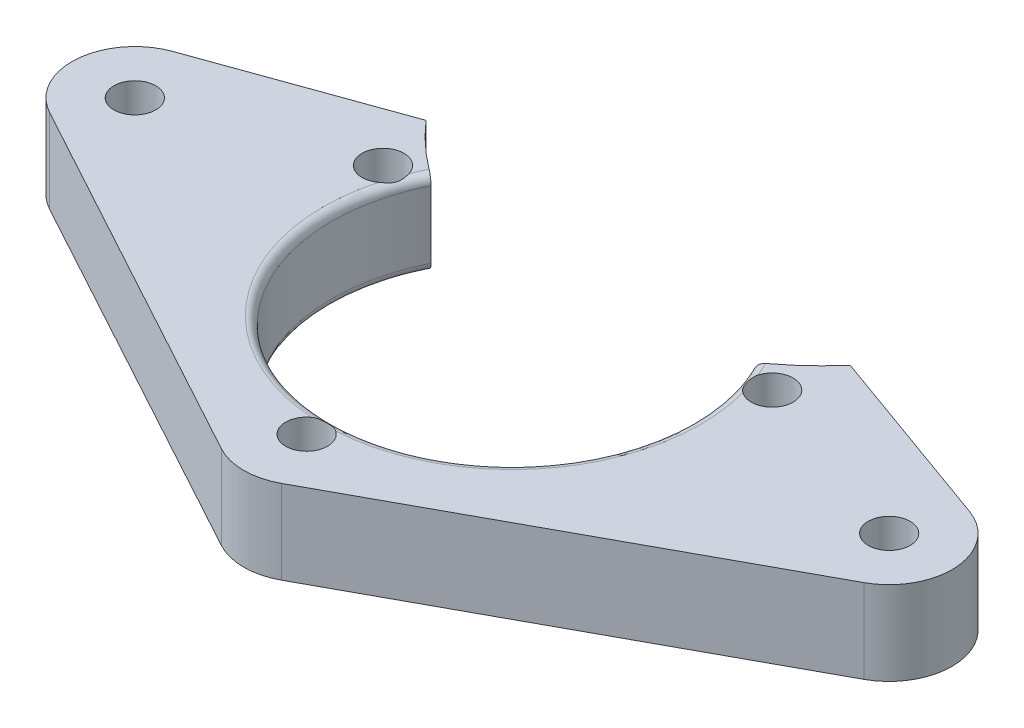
ISO-10303-21;
HEADER;
FILE_DESCRIPTION(('STEP AP214'),'2;1');
FILE_NAME('part.step','',(''),(''),'','','');
FILE_SCHEMA(('AUTOMOTIVE_DESIGN { 1 0 10303 214 1 1 1 1 }'));
ENDSEC;
DATA;
#1=APPLICATION_CONTEXT('core data for automotive mechanical design processes');
#2=APPLICATION_PROTOCOL_DEFINITION('international standard','automotive_design',2000,#1);
#3=PRODUCT_CONTEXT('',#1,'mechanical');
#4=PRODUCT('Part','Part','',(#3));
#5=PRODUCT_RELATED_PRODUCT_CATEGORY('part','',(#4));
#6=PRODUCT_DEFINITION_FORMATION('','',#4);
#7=PRODUCT_DEFINITION_CONTEXT('part definition',#1,'design');
#8=PRODUCT_DEFINITION('design','',#6,#7);
#9=PRODUCT_DEFINITION_SHAPE('','',#8);
#10=(LENGTH_UNIT() NAMED_UNIT(*) SI_UNIT(.MILLI.,.METRE.));
#11=(NAMED_UNIT(*) PLANE_ANGLE_UNIT() SI_UNIT($,.RADIAN.));
#12=(NAMED_UNIT(*) SI_UNIT($,.STERADIAN.) SOLID_ANGLE_UNIT());
#13=UNCERTAINTY_MEASURE_WITH_UNIT(LENGTH_MEASURE(1.E-05),#10,'distance_accuracy_value','');
#14=(GEOMETRIC_REPRESENTATION_CONTEXT(3) GLOBAL_UNCERTAINTY_ASSIGNED_CONTEXT((#13)) GLOBAL_UNIT_ASSIGNED_CONTEXT((#10,
#11,#12)) REPRESENTATION_CONTEXT('',''));
#15=CARTESIAN_POINT('',(0.,0.,0.));
#16=DIRECTION('',(0.,0.,1.));
#17=DIRECTION('',(1.,0.,0.));
#18=AXIS2_PLACEMENT_3D('',#15,#16,#17);
#19=CARTESIAN_POINT('',(0.,10.,0.));
#20=DIRECTION('',(0.,1.,0.));
#21=DIRECTION('',(0.,0.,1.));
#22=AXIS2_PLACEMENT_3D('',#19,#20,#21);
#23=PLANE('',#22);
#24=CARTESIAN_POINT('',(0.,10.,-37.));
#25=DIRECTION('',(0.,1.,0.));
#26=DIRECTION('',(0.,0.,1.));
#27=AXIS2_PLACEMENT_3D('',#24,#25,#26);
#28=CIRCLE('',#27,33.5);
#29=CARTESIAN_POINT('',(20.0675266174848,10.,-10.1756756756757));
#30=VERTEX_POINT('',#29);
#31=CARTESIAN_POINT('',(25.3037535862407,10.,-15.0461836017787));
#32=VERTEX_POINT('',#31);
#33=EDGE_CURVE('E208',#30,#32,#28,.T.);
#34=ORIENTED_EDGE('',*,*,#33,.F.);
#35=CARTESIAN_POINT('',(0.,10.,0.));
#36=DIRECTION('',(0.,1.,0.));
#37=DIRECTION('',(0.,0.,1.));
#38=AXIS2_PLACEMENT_3D('',#35,#36,#37);
#39=CIRCLE('',#38,22.5);
#40=CARTESIAN_POINT('',(20.8184791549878,10.,-8.53468954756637));
#41=VERTEX_POINT('',#40);
#42=EDGE_CURVE('E507',#30,#41,#39,.F.);
#43=ORIENTED_EDGE('',*,*,#42,.T.);
#44=CARTESIAN_POINT('',(23.2161733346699,10.,-7.82683177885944));
#45=DIRECTION('',(0.,1.,0.));
#46=DIRECTION('',(0.,0.,1.));
#47=AXIS2_PLACEMENT_3D('',#44,#45,#46);
#48=CIRCLE('',#47,2.5);
#49=CARTESIAN_POINT('',(21.7364474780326,10.,-5.81178552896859));
#50=VERTEX_POINT('',#49);
#51=EDGE_CURVE('E269',#50,#41,#48,.T.);
#52=ORIENTED_EDGE('',*,*,#51,.F.);
#53=CARTESIAN_POINT('',(0.,10.,0.));
#54=DIRECTION('',(0.,1.,0.));
#55=DIRECTION('',(0.,0.,1.));
#56=AXIS2_PLACEMENT_3D('',#53,#54,#55);
#57=CIRCLE('',#56,22.5);
#58=CARTESIAN_POINT('',(1.43673867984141,10.,22.4540816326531));
#59=VERTEX_POINT('',#58);
#60=EDGE_CURVE('E509',#50,#59,#57,.F.);
#61=ORIENTED_EDGE('',*,*,#60,.T.);
#62=CARTESIAN_POINT('',(0.,10.,24.5));
#63=DIRECTION('',(0.,1.,0.));
#64=DIRECTION('',(0.,0.,1.));
#65=AXIS2_PLACEMENT_3D('',#62,#63,#64);
#66=CIRCLE('',#65,2.5);
#67=CARTESIAN_POINT('',(-1.43673867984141,10.,22.4540816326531));
#68=VERTEX_POINT('',#67);
#69=EDGE_CURVE('E251',#68,#59,#66,.T.);
#70=ORIENTED_EDGE('',*,*,#69,.F.);
#71=CARTESIAN_POINT('',(0.,10.,0.));
#72=DIRECTION('',(0.,1.,0.));
#73=DIRECTION('',(0.,0.,1.));
#74=AXIS2_PLACEMENT_3D('',#71,#72,#73);
#75=CIRCLE('',#74,22.5);
#76=CARTESIAN_POINT('',(-21.7364474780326,10.,-5.81178552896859));
#77=VERTEX_POINT('',#76);
#78=EDGE_CURVE('E59',#68,#77,#75,.F.);
#79=ORIENTED_EDGE('',*,*,#78,.T.);
#80=CARTESIAN_POINT('',(-23.2161733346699,10.,-7.82683177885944));
#81=DIRECTION('',(0.,1.,0.));
#82=DIRECTION('',(0.,0.,1.));
#83=AXIS2_PLACEMENT_3D('',#80,#81,#82);
#84=CIRCLE('',#83,2.5);
#85=CARTESIAN_POINT('',(-20.8184791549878,10.,-8.53468954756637));
#86=VERTEX_POINT('',#85);
#87=EDGE_CURVE('E264',#86,#77,#84,.T.);
#88=ORIENTED_EDGE('',*,*,#87,.F.);
#89=CARTESIAN_POINT('',(0.,10.,0.));
#90=DIRECTION('',(0.,1.,0.));
#91=DIRECTION('',(0.,0.,1.));
#92=AXIS2_PLACEMENT_3D('',#89,#90,#91);
#93=CIRCLE('',#92,22.5);
#94=CARTESIAN_POINT('',(-20.0675266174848,10.,-10.1756756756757));
#95=VERTEX_POINT('',#94);
#96=EDGE_CURVE('E516',#86,#95,#93,.F.);
#97=ORIENTED_EDGE('',*,*,#96,.T.);
#98=CARTESIAN_POINT('',(0.,10.,-37.));
#99=DIRECTION('',(0.,1.,0.));
#100=DIRECTION('',(0.,0.,1.));
#101=AXIS2_PLACEMENT_3D('',#98,#99,#100);
#102=CIRCLE('',#101,33.5);
#103=CARTESIAN_POINT('',(-25.3037535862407,10.,-15.0461836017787));
#104=VERTEX_POINT('',#103);
#105=EDGE_CURVE('E192',#104,#95,#102,.T.);
#106=ORIENTED_EDGE('',*,*,#105,.F.);
#107=DIRECTION('',(0.941098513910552,0.,-0.338132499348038));
#108=VECTOR('',#107,1.);
#109=CARTESIAN_POINT('',(-7.68100516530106,10.,-21.3779585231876));
#110=LINE('',#109,#108);
#111=CARTESIAN_POINT('',(-47.5359937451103,10.,-7.05823885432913));
#112=VERTEX_POINT('',#111);
#113=EDGE_CURVE('E225',#112,#104,#110,.T.);
#114=ORIENTED_EDGE('',*,*,#113,.F.);
#115=CARTESIAN_POINT('',(-45.,10.,0.));
#116=DIRECTION('',(0.,1.,0.));
#117=DIRECTION('',(0.,0.,1.));
#118=AXIS2_PLACEMENT_3D('',#115,#116,#117);
#119=CIRCLE('',#118,7.5);
#120=CARTESIAN_POINT('',(-48.5862619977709,10.,6.58701183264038));
#121=VERTEX_POINT('',#120);
#122=EDGE_CURVE('E222',#112,#121,#119,.T.);
#123=ORIENTED_EDGE('',*,*,#122,.T.);
#124=DIRECTION('',(0.878268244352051,0.,0.47816826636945));
#125=VECTOR('',#124,1.);
#126=CARTESIAN_POINT('',(-13.8752820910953,10.,25.4852120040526));
#127=LINE('',#126,#125);
#128=CARTESIAN_POINT('',(-3.58626199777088,10.,31.0870118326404));
#129=VERTEX_POINT('',#128);
#130=EDGE_CURVE('E219',#121,#129,#127,.T.);
#131=ORIENTED_EDGE('',*,*,#130,.T.);
#132=CARTESIAN_POINT('',(0.,10.,24.5));
#133=DIRECTION('',(0.,1.,0.));
#134=DIRECTION('',(0.,0.,1.));
#135=AXIS2_PLACEMENT_3D('',#132,#133,#134);
#136=CIRCLE('',#135,7.5);
#137=CARTESIAN_POINT('',(3.58626199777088,10.,31.0870118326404));
#138=VERTEX_POINT('',#137);
#139=EDGE_CURVE('E216',#129,#138,#136,.T.);
#140=ORIENTED_EDGE('',*,*,#139,.T.);
#141=DIRECTION('',(-0.878268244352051,0.,0.47816826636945));
#142=VECTOR('',#141,1.);
#143=CARTESIAN_POINT('',(13.8752820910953,10.,25.4852120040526));
#144=LINE('',#143,#142);
#145=CARTESIAN_POINT('',(48.5862619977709,10.,6.58701183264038));
#146=VERTEX_POINT('',#145);
#147=EDGE_CURVE('E213',#146,#138,#144,.T.);
#148=ORIENTED_EDGE('',*,*,#147,.F.);
#149=CARTESIAN_POINT('',(45.,10.,0.));
#150=DIRECTION('',(0.,1.,0.));
#151=DIRECTION('',(0.,0.,1.));
#152=AXIS2_PLACEMENT_3D('',#149,#150,#151);
#153=CIRCLE('',#152,7.5);
#154=CARTESIAN_POINT('',(47.5359937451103,10.,-7.05823885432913));
#155=VERTEX_POINT('',#154);
#156=EDGE_CURVE('E211',#146,#155,#153,.T.);
#157=ORIENTED_EDGE('',*,*,#156,.T.);
#158=DIRECTION('',(-0.94109851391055,0.,-0.338132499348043));
#159=VECTOR('',#158,1.);
#160=CARTESIAN_POINT('',(7.68100516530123,10.,-21.3779585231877));
#161=LINE('',#160,#159);
#162=EDGE_CURVE('E181',#155,#32,#161,.T.);
#163=ORIENTED_EDGE('',*,*,#162,.T.);
#164=EDGE_LOOP('',(#34,#43,#52,#61,#70,#79,#88,#97,#106,#114,#123,#131,#140,#148,#157,#163));
#165=FACE_BOUND('',#164,.T.);
#166=CARTESIAN_POINT('',(45.,10.,0.));
#167=DIRECTION('',(0.,1.,0.));
#168=DIRECTION('',(0.,0.,1.));
#169=AXIS2_PLACEMENT_3D('',#166,#167,#168);
#170=CIRCLE('',#169,2.49999999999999);
#171=CARTESIAN_POINT('',(45.,10.,2.49999999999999));
#172=VERTEX_POINT('',#171);
#173=EDGE_CURVE('E233',#172,#172,#170,.T.);
#174=ORIENTED_EDGE('',*,*,#173,.F.);
#175=EDGE_LOOP('',(#174));
#176=FACE_BOUND('',#175,.T.);
#177=CARTESIAN_POINT('',(-45.,10.,0.));
#178=DIRECTION('',(0.,1.,0.));
#179=DIRECTION('',(0.,0.,1.));
#180=AXIS2_PLACEMENT_3D('',#177,#178,#179);
#181=CIRCLE('',#180,2.49999999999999);
#182=CARTESIAN_POINT('',(-45.,10.,2.49999999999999));
#183=VERTEX_POINT('',#182);
#184=EDGE_CURVE('E252',#183,#183,#181,.T.);
#185=ORIENTED_EDGE('',*,*,#184,.F.);
#186=EDGE_LOOP('',(#185));
#187=FACE_BOUND('',#186,.T.);
#188=ADVANCED_FACE('F33',(#165,#176,#187),#23,.T.);
#189=CARTESIAN_POINT('',(0.,0.,0.));
#190=DIRECTION('',(0.,1.,0.));
#191=DIRECTION('',(0.,0.,1.));
#192=AXIS2_PLACEMENT_3D('',#189,#190,#191);
#193=PLANE('',#192);
#194=CARTESIAN_POINT('',(0.,0.,-37.));
#195=DIRECTION('',(0.,1.,0.));
#196=DIRECTION('',(0.,0.,1.));
#197=AXIS2_PLACEMENT_3D('',#194,#195,#196);
#198=CIRCLE('',#197,33.5);
#199=CARTESIAN_POINT('',(-25.3037535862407,0.,-15.0461836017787));
#200=VERTEX_POINT('',#199);
#201=CARTESIAN_POINT('',(-20.0675266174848,0.,-10.1756756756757));
#202=VERTEX_POINT('',#201);
#203=EDGE_CURVE('E205',#200,#202,#198,.T.);
#204=ORIENTED_EDGE('',*,*,#203,.T.);
#205=CARTESIAN_POINT('',(0.,0.,0.));
#206=DIRECTION('',(0.,1.,0.));
#207=DIRECTION('',(0.,0.,1.));
#208=AXIS2_PLACEMENT_3D('',#205,#206,#207);
#209=CIRCLE('',#208,22.5);
#210=CARTESIAN_POINT('',(-20.8184791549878,0.,-8.53468954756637));
#211=VERTEX_POINT('',#210);
#212=EDGE_CURVE('E282',#202,#211,#209,.T.);
#213=ORIENTED_EDGE('',*,*,#212,.T.);
#214=CARTESIAN_POINT('',(-23.2161733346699,0.,-7.82683177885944));
#215=DIRECTION('',(0.,1.,0.));
#216=DIRECTION('',(0.,0.,1.));
#217=AXIS2_PLACEMENT_3D('',#214,#215,#216);
#218=CIRCLE('',#217,2.5);
#219=CARTESIAN_POINT('',(-21.7364474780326,0.,-5.81178552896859));
#220=VERTEX_POINT('',#219);
#221=EDGE_CURVE('E260',#211,#220,#218,.T.);
#222=ORIENTED_EDGE('',*,*,#221,.T.);
#223=CARTESIAN_POINT('',(0.,0.,0.));
#224=DIRECTION('',(0.,1.,0.));
#225=DIRECTION('',(0.,0.,1.));
#226=AXIS2_PLACEMENT_3D('',#223,#224,#225);
#227=CIRCLE('',#226,22.5);
#228=CARTESIAN_POINT('',(-1.43673867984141,0.,22.4540816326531));
#229=VERTEX_POINT('',#228);
#230=EDGE_CURVE('E280',#220,#229,#227,.T.);
#231=ORIENTED_EDGE('',*,*,#230,.T.);
#232=CARTESIAN_POINT('',(0.,0.,24.5));
#233=DIRECTION('',(0.,1.,0.));
#234=DIRECTION('',(0.,0.,1.));
#235=AXIS2_PLACEMENT_3D('',#232,#233,#234);
#236=CIRCLE('',#235,2.5);
#237=CARTESIAN_POINT('',(1.43673867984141,0.,22.4540816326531));
#238=VERTEX_POINT('',#237);
#239=EDGE_CURVE('E272',#229,#238,#236,.T.);
#240=ORIENTED_EDGE('',*,*,#239,.T.);
#241=CARTESIAN_POINT('',(0.,0.,0.));
#242=DIRECTION('',(0.,1.,0.));
#243=DIRECTION('',(0.,0.,1.));
#244=AXIS2_PLACEMENT_3D('',#241,#242,#243);
#245=CIRCLE('',#244,22.5);
#246=CARTESIAN_POINT('',(21.7364474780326,0.,-5.81178552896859));
#247=VERTEX_POINT('',#246);
#248=EDGE_CURVE('E278',#238,#247,#245,.T.);
#249=ORIENTED_EDGE('',*,*,#248,.T.);
#250=CARTESIAN_POINT('',(23.2161733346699,0.,-7.82683177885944));
#251=DIRECTION('',(0.,1.,0.));
#252=DIRECTION('',(0.,0.,1.));
#253=AXIS2_PLACEMENT_3D('',#250,#251,#252);
#254=CIRCLE('',#253,2.5);
#255=CARTESIAN_POINT('',(20.8184791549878,0.,-8.53468954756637));
#256=VERTEX_POINT('',#255);
#257=EDGE_CURVE('E266',#247,#256,#254,.T.);
#258=ORIENTED_EDGE('',*,*,#257,.T.);
#259=CARTESIAN_POINT('',(0.,0.,0.));
#260=DIRECTION('',(0.,1.,0.));
#261=DIRECTION('',(0.,0.,1.));
#262=AXIS2_PLACEMENT_3D('',#259,#260,#261);
#263=CIRCLE('',#262,22.5);
#264=CARTESIAN_POINT('',(20.0675266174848,0.,-10.1756756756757));
#265=VERTEX_POINT('',#264);
#266=EDGE_CURVE('E263',#256,#265,#263,.T.);
#267=ORIENTED_EDGE('',*,*,#266,.T.);
#268=CARTESIAN_POINT('',(0.,0.,-37.));
#269=DIRECTION('',(0.,1.,0.));
#270=DIRECTION('',(0.,0.,1.));
#271=AXIS2_PLACEMENT_3D('',#268,#269,#270);
#272=CIRCLE('',#271,33.5);
#273=CARTESIAN_POINT('',(25.3037535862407,0.,-15.0461836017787));
#274=VERTEX_POINT('',#273);
#275=EDGE_CURVE('E189',#265,#274,#272,.T.);
#276=ORIENTED_EDGE('',*,*,#275,.T.);
#277=DIRECTION('',(-0.94109851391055,0.,-0.338132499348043));
#278=VECTOR('',#277,1.);
#279=CARTESIAN_POINT('',(7.68100516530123,0.,-21.3779585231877));
#280=LINE('',#279,#278);
#281=CARTESIAN_POINT('',(47.5359937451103,0.,-7.05823885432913));
#282=VERTEX_POINT('',#281);
#283=EDGE_CURVE('E174',#282,#274,#280,.T.);
#284=ORIENTED_EDGE('',*,*,#283,.F.);
#285=CARTESIAN_POINT('',(45.,0.,0.));
#286=DIRECTION('',(0.,1.,0.));
#287=DIRECTION('',(0.,0.,1.));
#288=AXIS2_PLACEMENT_3D('',#285,#286,#287);
#289=CIRCLE('',#288,7.5);
#290=CARTESIAN_POINT('',(48.5862619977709,0.,6.58701183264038));
#291=VERTEX_POINT('',#290);
#292=EDGE_CURVE('E162',#291,#282,#289,.T.);
#293=ORIENTED_EDGE('',*,*,#292,.F.);
#294=DIRECTION('',(-0.878268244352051,0.,0.47816826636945));
#295=VECTOR('',#294,1.);
#296=CARTESIAN_POINT('',(13.8752820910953,0.,25.4852120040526));
#297=LINE('',#296,#295);
#298=CARTESIAN_POINT('',(3.58626199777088,0.,31.0870118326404));
#299=VERTEX_POINT('',#298);
#300=EDGE_CURVE('E173',#291,#299,#297,.T.);
#301=ORIENTED_EDGE('',*,*,#300,.T.);
#302=CARTESIAN_POINT('',(0.,0.,24.5));
#303=DIRECTION('',(0.,1.,0.));
#304=DIRECTION('',(0.,0.,1.));
#305=AXIS2_PLACEMENT_3D('',#302,#303,#304);
#306=CIRCLE('',#305,7.5);
#307=CARTESIAN_POINT('',(-3.58626199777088,0.,31.0870118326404));
#308=VERTEX_POINT('',#307);
#309=EDGE_CURVE('E196',#308,#299,#306,.T.);
#310=ORIENTED_EDGE('',*,*,#309,.F.);
#311=DIRECTION('',(0.878268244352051,0.,0.47816826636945));
#312=VECTOR('',#311,1.);
#313=CARTESIAN_POINT('',(-13.8752820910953,0.,25.4852120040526));
#314=LINE('',#313,#312);
#315=CARTESIAN_POINT('',(-48.5862619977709,0.,6.58701183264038));
#316=VERTEX_POINT('',#315);
#317=EDGE_CURVE('E198',#316,#308,#314,.T.);
#318=ORIENTED_EDGE('',*,*,#317,.F.);
#319=CARTESIAN_POINT('',(-45.,0.,0.));
#320=DIRECTION('',(0.,1.,0.));
#321=DIRECTION('',(0.,0.,1.));
#322=AXIS2_PLACEMENT_3D('',#319,#320,#321);
#323=CIRCLE('',#322,7.5);
#324=CARTESIAN_POINT('',(-47.5359937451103,0.,-7.05823885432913));
#325=VERTEX_POINT('',#324);
#326=EDGE_CURVE('E200',#325,#316,#323,.T.);
#327=ORIENTED_EDGE('',*,*,#326,.F.);
#328=DIRECTION('',(0.941098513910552,0.,-0.338132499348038));
#329=VECTOR('',#328,1.);
#330=CARTESIAN_POINT('',(-7.68100516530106,0.,-21.3779585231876));
#331=LINE('',#330,#329);
#332=EDGE_CURVE('E202',#325,#200,#331,.T.);
#333=ORIENTED_EDGE('',*,*,#332,.T.);
#334=EDGE_LOOP('',(#204,#213,#222,#231,#240,#249,#258,#267,#276,#284,#293,#301,#310,#318,#327,#333));
#335=FACE_BOUND('',#334,.T.);
#336=CARTESIAN_POINT('',(45.,0.,0.));
#337=DIRECTION('',(0.,1.,0.));
#338=DIRECTION('',(0.,0.,1.));
#339=AXIS2_PLACEMENT_3D('',#336,#337,#338);
#340=CIRCLE('',#339,2.49999999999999);
#341=CARTESIAN_POINT('',(45.,0.,2.49999999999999));
#342=VERTEX_POINT('',#341);
#343=EDGE_CURVE('E255',#342,#342,#340,.T.);
#344=ORIENTED_EDGE('',*,*,#343,.T.);
#345=EDGE_LOOP('',(#344));
#346=FACE_BOUND('',#345,.T.);
#347=CARTESIAN_POINT('',(-45.,0.,0.));
#348=DIRECTION('',(0.,1.,0.));
#349=DIRECTION('',(0.,0.,1.));
#350=AXIS2_PLACEMENT_3D('',#347,#348,#349);
#351=CIRCLE('',#350,2.49999999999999);
#352=CARTESIAN_POINT('',(-45.,0.,2.49999999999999));
#353=VERTEX_POINT('',#352);
#354=EDGE_CURVE('E248',#353,#353,#351,.T.);
#355=ORIENTED_EDGE('',*,*,#354,.T.);
#356=EDGE_LOOP('',(#355));
#357=FACE_BOUND('',#356,.T.);
#358=ADVANCED_FACE('F186',(#335,#346,#357),#193,.F.);
#359=CARTESIAN_POINT('',(0.,0.,24.5));
#360=DIRECTION('',(0.,1.,0.));
#361=DIRECTION('',(0.,0.,1.));
#362=AXIS2_PLACEMENT_3D('',#359,#360,#361);
#363=CYLINDRICAL_SURFACE('',#362,2.5);
#364=ORIENTED_EDGE('',*,*,#239,.F.);
#365=CARTESIAN_POINT('',(-1.43673867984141,0.,22.4540816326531));
#366=CARTESIAN_POINT('',(-1.38761921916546,1.71798852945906E-05,22.419579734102));
#367=CARTESIAN_POINT('',(-1.33730693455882,0.00211480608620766,22.3868970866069));
#368=CARTESIAN_POINT('',(-1.23470646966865,0.0093487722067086,22.3253590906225));
#369=CARTESIAN_POINT('',(-1.1824217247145,0.0144800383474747,22.2964974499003));
#370=CARTESIAN_POINT('',(-1.07586457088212,0.0266959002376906,22.2425449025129));
#371=CARTESIAN_POINT('',(-1.02158381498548,0.0337897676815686,22.2174727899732));
#372=CARTESIAN_POINT('',(-0.911453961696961,0.0489031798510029,22.1713055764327));
#373=CARTESIAN_POINT('',(-0.855604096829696,0.0569231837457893,22.1502124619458));
#374=CARTESIAN_POINT('',(-0.739379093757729,0.0733634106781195,22.1110071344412));
#375=CARTESIAN_POINT('',(-0.678925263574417,0.0817810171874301,22.0931266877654));
#376=CARTESIAN_POINT('',(-0.556704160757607,0.0974976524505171,22.0619563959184));
#377=CARTESIAN_POINT('',(-0.49493703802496,0.104796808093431,22.0486660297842));
#378=CARTESIAN_POINT('',(-0.370636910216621,0.117303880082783,22.0268256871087));
#379=CARTESIAN_POINT('',(-0.308108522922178,0.122520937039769,22.0182549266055));
#380=CARTESIAN_POINT('',(-0.182411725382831,0.130200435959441,22.0058642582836));
#381=CARTESIAN_POINT('',(-0.119243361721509,0.132663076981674,22.002044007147));
#382=CARTESIAN_POINT('',(0.00969564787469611,0.134515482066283,21.999155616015));
#383=CARTESIAN_POINT('',(0.0754725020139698,0.133782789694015,22.0002768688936));
#384=CARTESIAN_POINT('',(0.206615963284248,0.129076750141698,22.0076868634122));
#385=CARTESIAN_POINT('',(0.271982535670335,0.125103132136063,22.0139760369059));
#386=CARTESIAN_POINT('',(0.402129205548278,0.11448865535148,22.0316750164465));
#387=CARTESIAN_POINT('',(0.466904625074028,0.107834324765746,22.0431107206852));
#388=CARTESIAN_POINT('',(0.595168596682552,0.092812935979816,22.0709911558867));
#389=CARTESIAN_POINT('',(0.6586568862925,0.0844455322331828,22.0874368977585));
#390=CARTESIAN_POINT('',(0.785066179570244,0.0670090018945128,22.1255322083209));
#391=CARTESIAN_POINT('',(0.847962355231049,0.0579308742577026,22.1472599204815));
#392=CARTESIAN_POINT('',(0.971880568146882,0.040507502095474,22.1956839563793));
#393=CARTESIAN_POINT('',(1.03290356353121,0.0321618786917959,22.2223776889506));
#394=CARTESIAN_POINT('',(1.15249247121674,0.0176283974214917,22.2805071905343));
#395=CARTESIAN_POINT('',(1.21107081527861,0.0114280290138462,22.3119138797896));
#396=CARTESIAN_POINT('',(1.32583798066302,0.00262344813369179,22.3794791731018));
#397=CARTESIAN_POINT('',(1.38202200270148,2.61568474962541E-05,22.4156467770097));
#398=CARTESIAN_POINT('',(1.43673867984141,0.,22.4540816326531));
#399=B_SPLINE_CURVE_WITH_KNOTS('',3,(#365,#366,#367,#368,#369,#370,#371,#372,#373,#374,#375,
#376,#377,#378,#379,#380,#381,#382,#383,#384,#385,#386,#387,#388,#389,#390,#391,#392,#393,#394,
#395,#396,#397,#398),.UNSPECIFIED.,.F.,.F.,(4,2,2,2,2,2,2,2,2,2,2,2,2,2,2,2,4),(0.,
0.179905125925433,0.359510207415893,0.539978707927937,0.720537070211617,0.911162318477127,
1.10176592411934,1.29152330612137,1.48126697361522,1.67834487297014,1.87543924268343,
2.07353671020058,2.27167417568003,2.47294341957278,2.67410793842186,2.8740787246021,
3.07443310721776),.UNSPECIFIED.);
#400=EDGE_CURVE('E292',#229,#238,#399,.T.);
#401=ORIENTED_EDGE('',*,*,#400,.T.);
#402=EDGE_LOOP('',(#364,#401));
#403=FACE_BOUND('',#402,.T.);
#404=ORIENTED_EDGE('',*,*,#69,.T.);
#405=CARTESIAN_POINT('',(1.43673867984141,10.,22.4540816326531));
#406=CARTESIAN_POINT('',(1.38761921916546,9.99998282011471,22.419579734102));
#407=CARTESIAN_POINT('',(1.33730693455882,9.99788519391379,22.3868970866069));
#408=CARTESIAN_POINT('',(1.23470646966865,9.99065122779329,22.3253590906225));
#409=CARTESIAN_POINT('',(1.1824217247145,9.98551996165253,22.2964974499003));
#410=CARTESIAN_POINT('',(1.07586457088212,9.97330409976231,22.2425449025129));
#411=CARTESIAN_POINT('',(1.02158381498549,9.96621023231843,22.2174727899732));
#412=CARTESIAN_POINT('',(0.911453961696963,9.951096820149,22.1713055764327));
#413=CARTESIAN_POINT('',(0.855604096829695,9.94307681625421,22.1502124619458));
#414=CARTESIAN_POINT('',(0.739379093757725,9.92663658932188,22.1110071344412));
#415=CARTESIAN_POINT('',(0.678925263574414,9.91821898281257,22.0931266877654));
#416=CARTESIAN_POINT('',(0.556704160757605,9.90250234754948,22.0619563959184));
#417=CARTESIAN_POINT('',(0.494937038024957,9.89520319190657,22.0486660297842));
#418=CARTESIAN_POINT('',(0.370636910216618,9.88269611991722,22.0268256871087));
#419=CARTESIAN_POINT('',(0.308108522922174,9.87747906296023,22.0182549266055));
#420=CARTESIAN_POINT('',(0.182411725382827,9.86979956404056,22.0058642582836));
#421=CARTESIAN_POINT('',(0.119243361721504,9.86733692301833,22.002044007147));
#422=CARTESIAN_POINT('',(-0.00969564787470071,9.86548451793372,21.999155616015));
#423=CARTESIAN_POINT('',(-0.0754725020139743,9.86621721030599,22.0002768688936));
#424=CARTESIAN_POINT('',(-0.206615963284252,9.8709232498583,22.0076868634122));
#425=CARTESIAN_POINT('',(-0.271982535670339,9.87489686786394,22.0139760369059));
#426=CARTESIAN_POINT('',(-0.402129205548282,9.88551134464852,22.0316750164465));
#427=CARTESIAN_POINT('',(-0.466904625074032,9.89216567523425,22.0431107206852));
#428=CARTESIAN_POINT('',(-0.595168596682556,9.90718706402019,22.0709911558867));
#429=CARTESIAN_POINT('',(-0.658656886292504,9.91555446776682,22.0874368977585));
#430=CARTESIAN_POINT('',(-0.785066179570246,9.93299099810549,22.1255322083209));
#431=CARTESIAN_POINT('',(-0.847962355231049,9.9420691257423,22.1472599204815));
#432=CARTESIAN_POINT('',(-0.971880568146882,9.95949249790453,22.1956839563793));
#433=CARTESIAN_POINT('',(-1.03290356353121,9.9678381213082,22.2223776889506));
#434=CARTESIAN_POINT('',(-1.15249247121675,9.98237160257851,22.2805071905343));
#435=CARTESIAN_POINT('',(-1.21107081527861,9.98857197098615,22.3119138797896));
#436=CARTESIAN_POINT('',(-1.32583798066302,9.99737655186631,22.3794791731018));
#437=CARTESIAN_POINT('',(-1.38202200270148,9.9999738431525,22.4156467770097));
#438=CARTESIAN_POINT('',(-1.43673867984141,10.,22.4540816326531));
#439=B_SPLINE_CURVE_WITH_KNOTS('',3,(#405,#406,#407,#408,#409,#410,#411,#412,#413,#414,#415,
#416,#417,#418,#419,#420,#421,#422,#423,#424,#425,#426,#427,#428,#429,#430,#431,#432,#433,#434,
#435,#436,#437,#438),.UNSPECIFIED.,.F.,.F.,(4,2,2,2,2,2,2,2,2,2,2,2,2,2,2,2,4),(0.,
0.179905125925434,0.359510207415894,0.539978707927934,0.72053707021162,0.91116231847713,
1.10176592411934,1.29152330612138,1.48126697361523,1.67834487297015,1.87543924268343,
2.07353671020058,2.27167417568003,2.47294341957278,2.67410793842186,2.8740787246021,
3.07443310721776),.UNSPECIFIED.);
#440=EDGE_CURVE('E318',#59,#68,#439,.T.);
#441=ORIENTED_EDGE('',*,*,#440,.T.);
#442=EDGE_LOOP('',(#404,#441));
#443=FACE_BOUND('',#442,.T.);
#444=ADVANCED_FACE('F330',(#403,#443),#363,.F.);
#445=CARTESIAN_POINT('',(23.2161733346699,0.,-7.82683177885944));
#446=DIRECTION('',(0.,1.,0.));
#447=DIRECTION('',(0.,0.,1.));
#448=AXIS2_PLACEMENT_3D('',#445,#446,#447);
#449=CYLINDRICAL_SURFACE('',#448,2.5);
#450=ORIENTED_EDGE('',*,*,#257,.F.);
#451=CARTESIAN_POINT('',(21.7364474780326,0.,-5.81178552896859));
#452=CARTESIAN_POINT('',(21.6880616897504,1.71798852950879E-05,-5.84730901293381));
#453=CARTESIAN_POINT('',(21.6410187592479,0.00211480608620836,-5.88454399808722));
#454=CARTESIAN_POINT('',(21.5499284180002,0.00934877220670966,-5.96210900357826));
#455=CARTESIAN_POINT('',(21.5058761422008,0.0144800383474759,-6.00243375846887));
#456=CARTESIAN_POINT('',(21.4207097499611,0.0266959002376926,-6.08617138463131));
#457=CARTESIAN_POINT('',(21.3796107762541,0.0337897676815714,-6.12959816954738));
#458=CARTESIAN_POINT('',(21.3006804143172,0.0489031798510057,-6.21920840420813));
#459=CARTESIAN_POINT('',(21.262850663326,0.0569231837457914,-6.26539321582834));
#460=CARTESIAN_POINT('',(21.1885702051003,0.0733634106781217,-6.36300326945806));
#461=CARTESIAN_POINT('',(21.1523139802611,0.0817810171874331,-6.41457712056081));
#462=CARTESIAN_POINT('',(21.0837319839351,0.0974976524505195,-6.52043596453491));
#463=CARTESIAN_POINT('',(21.051405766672,0.104796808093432,-6.57472064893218));
#464=CARTESIAN_POINT('',(20.9910006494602,0.117303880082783,-6.68553014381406));
#465=CARTESIAN_POINT('',(20.9629035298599,0.122520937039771,-6.74204393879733));
#466=CARTESIAN_POINT('',(20.9110067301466,0.130200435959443,-6.8571957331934));
#467=CARTESIAN_POINT('',(20.8872067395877,0.132663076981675,-6.91583357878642));
#468=CARTESIAN_POINT('',(20.8432785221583,0.134515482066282,-7.03709331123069));
#469=CARTESIAN_POINT('',(20.8233277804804,0.133782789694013,-7.09978158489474));
#470=CARTESIAN_POINT('',(20.7884540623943,0.129076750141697,-7.22642020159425));
#471=CARTESIAN_POINT('',(20.77353150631,0.125103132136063,-7.29037064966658));
#472=CARTESIAN_POINT('',(20.7487260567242,0.114488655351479,-7.41935165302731));
#473=CARTESIAN_POINT('',(20.738869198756,0.107834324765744,-7.48438604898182));
#474=CARTESIAN_POINT('',(20.7243131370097,0.0928129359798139,-7.6148356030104));
#475=CARTESIAN_POINT('',(20.7196149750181,0.0844455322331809,-7.68025083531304));
#476=CARTESIAN_POINT('',(20.7153310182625,0.067009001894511,-7.81220616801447));
#477=CARTESIAN_POINT('',(20.7158272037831,0.0579308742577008,-7.87874770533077));
#478=CARTESIAN_POINT('',(20.7221265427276,0.0405075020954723,-8.0116421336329));
#479=CARTESIAN_POINT('',(20.7279269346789,0.0321618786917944,-8.07799510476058));
#480=CARTESIAN_POINT('',(20.7448062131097,0.0176283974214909,-8.20988762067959));
#481=CARTESIAN_POINT('',(20.7558535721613,0.0114280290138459,-8.27542965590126));
#482=CARTESIAN_POINT('',(20.7832145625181,0.00262344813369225,-8.40576747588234));
#483=CARTESIAN_POINT('',(20.7995382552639,2.6156847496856E-05,-8.47056158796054));
#484=CARTESIAN_POINT('',(20.8184791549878,0.,-8.53468954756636));
#485=B_SPLINE_CURVE_WITH_KNOTS('',3,(#451,#452,#453,#454,#455,#456,#457,#458,#459,#460,#461,
#462,#463,#464,#465,#466,#467,#468,#469,#470,#471,#472,#473,#474,#475,#476,#477,#478,#479,#480,
#481,#482,#483,#484),.UNSPECIFIED.,.F.,.F.,(4,2,2,2,2,2,2,2,2,2,2,2,2,2,2,2,4),(0.,
0.179905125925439,0.3595102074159,0.539978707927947,0.720537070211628,0.911162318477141,
1.10176592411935,1.29152330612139,1.48126697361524,1.67834487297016,1.87543924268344,
2.07353671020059,2.27167417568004,2.47294341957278,2.67410793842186,2.8740787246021,
3.07443310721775),.UNSPECIFIED.);
#486=EDGE_CURVE('E536',#247,#256,#485,.T.);
#487=ORIENTED_EDGE('',*,*,#486,.T.);
#488=EDGE_LOOP('',(#450,#487));
#489=FACE_BOUND('',#488,.T.);
#490=ORIENTED_EDGE('',*,*,#51,.T.);
#491=CARTESIAN_POINT('',(20.8184791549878,10.,-8.53468954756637));
#492=CARTESIAN_POINT('',(20.8014770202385,9.99998282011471,-8.47712193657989));
#493=CARTESIAN_POINT('',(20.7865798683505,9.99788519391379,-8.41900518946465));
#494=CARTESIAN_POINT('',(20.7610435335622,9.99065122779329,-8.30212201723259));
#495=CARTESIAN_POINT('',(20.7503972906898,9.98551996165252,-8.24335683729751));
#496=CARTESIAN_POINT('',(20.7333129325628,9.97330409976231,-8.12514757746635));
#497=CARTESIAN_POINT('',(20.7268952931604,9.96621023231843,-8.06570159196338));
#498=CARTESIAN_POINT('',(20.7183296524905,9.951096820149,-7.94659396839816));
#499=CARTESIAN_POINT('',(20.7161837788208,9.94307681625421,-7.88693223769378));
#500=CARTESIAN_POINT('',(20.7161623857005,9.92663658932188,-7.76427291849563));
#501=CARTESIAN_POINT('',(20.7185316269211,9.91821898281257,-7.70127480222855));
#502=CARTESIAN_POINT('',(20.7280397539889,9.90250234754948,-7.57550047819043));
#503=CARTESIAN_POINT('',(20.7351780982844,9.89520319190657,-7.51272424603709));
#504=CARTESIAN_POINT('',(20.7541914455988,9.88269611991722,-7.38796040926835));
#505=CARTESIAN_POINT('',(20.7660452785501,9.87747906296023,-7.32597054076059));
#506=CARTESIAN_POINT('',(20.7944593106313,9.86979956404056,-7.20290203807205));
#507=CARTESIAN_POINT('',(20.8110191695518,9.86733692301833,-7.1418233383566));
#508=CARTESIAN_POINT('',(20.8494733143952,9.86548451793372,-7.01871814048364));
#509=CARTESIAN_POINT('',(20.871549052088,9.86621721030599,-6.95674626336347));
#510=CARTESIAN_POINT('',(20.9204661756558,9.8709232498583,-6.83484207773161));
#511=CARTESIAN_POINT('',(20.9473079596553,9.87489686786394,-6.77490994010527));
#512=CARTESIAN_POINT('',(21.00565647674,9.88551134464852,-6.65723725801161));
#513=CARTESIAN_POINT('',(21.0371862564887,9.89216567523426,-6.59950941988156));
#514=CARTESIAN_POINT('',(21.1045812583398,9.90718706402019,-6.48687337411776));
#515=CARTESIAN_POINT('',(21.1404473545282,9.91555446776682,-6.43196573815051));
#516=CARTESIAN_POINT('',(21.2169294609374,9.93299099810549,-6.32435045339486));
#517=CARTESIAN_POINT('',(21.2576115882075,9.9420691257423,-6.27169129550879));
#518=CARTESIAN_POINT('',(21.343085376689,9.95949249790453,-6.16973619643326));
#519=CARTESIAN_POINT('',(21.3878748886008,9.96783812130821,-6.12043851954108));
#520=CARTESIAN_POINT('',(21.4811625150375,9.98237160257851,-6.02568639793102));
#521=CARTESIAN_POINT('',(21.5296370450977,9.98857197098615,-5.98021088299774));
#522=CARTESIAN_POINT('',(21.6303256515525,9.99737655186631,-5.89304222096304));
#523=CARTESIAN_POINT('',(21.6825467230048,9.9999738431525,-5.85135649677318));
#524=CARTESIAN_POINT('',(21.7364474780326,10.,-5.81178552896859));
#525=B_SPLINE_CURVE_WITH_KNOTS('',3,(#491,#492,#493,#494,#495,#496,#497,#498,#499,#500,#501,
#502,#503,#504,#505,#506,#507,#508,#509,#510,#511,#512,#513,#514,#515,#516,#517,#518,#519,#520,
#521,#522,#523,#524),.UNSPECIFIED.,.F.,.F.,(4,2,2,2,2,2,2,2,2,2,2,2,2,2,2,2,4),(0.,
0.179905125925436,0.359510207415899,0.539978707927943,0.720537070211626,0.911162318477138,
1.10176592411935,1.29152330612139,1.48126697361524,1.67834487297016,1.87543924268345,
2.07353671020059,2.27167417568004,2.47294341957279,2.67410793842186,2.8740787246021,
3.07443310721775),.UNSPECIFIED.);
#526=EDGE_CURVE('E324',#41,#50,#525,.T.);
#527=ORIENTED_EDGE('',*,*,#526,.T.);
#528=EDGE_LOOP('',(#490,#527));
#529=FACE_BOUND('',#528,.T.);
#530=ADVANCED_FACE('F308',(#489,#529),#449,.F.);
#531=CARTESIAN_POINT('',(-23.2161733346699,0.,-7.82683177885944));
#532=DIRECTION('',(0.,1.,0.));
#533=DIRECTION('',(0.,0.,1.));
#534=AXIS2_PLACEMENT_3D('',#531,#532,#533);
#535=CYLINDRICAL_SURFACE('',#534,2.5);
#536=ORIENTED_EDGE('',*,*,#221,.F.);
#537=CARTESIAN_POINT('',(-20.8184791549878,0.,-8.53468954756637));
#538=CARTESIAN_POINT('',(-20.8014770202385,1.71798852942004E-05,-8.47712193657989));
#539=CARTESIAN_POINT('',(-20.7865798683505,0.00211480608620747,-8.41900518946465));
#540=CARTESIAN_POINT('',(-20.7610435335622,0.00934877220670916,-8.30212201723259));
#541=CARTESIAN_POINT('',(-20.7503972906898,0.0144800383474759,-8.24335683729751));
#542=CARTESIAN_POINT('',(-20.7333129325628,0.0266959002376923,-8.12514757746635));
#543=CARTESIAN_POINT('',(-20.7268952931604,0.0337897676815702,-8.06570159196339));
#544=CARTESIAN_POINT('',(-20.7183296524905,0.0489031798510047,-7.94659396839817));
#545=CARTESIAN_POINT('',(-20.7161837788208,0.0569231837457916,-7.88693223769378));
#546=CARTESIAN_POINT('',(-20.7161623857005,0.0733634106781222,-7.76427291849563));
#547=CARTESIAN_POINT('',(-20.7185316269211,0.0817810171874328,-7.70127480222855));
#548=CARTESIAN_POINT('',(-20.7280397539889,0.0974976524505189,-7.57550047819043));
#549=CARTESIAN_POINT('',(-20.7351780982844,0.104796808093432,-7.51272424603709));
#550=CARTESIAN_POINT('',(-20.7541914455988,0.117303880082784,-7.38796040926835));
#551=CARTESIAN_POINT('',(-20.7660452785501,0.122520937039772,-7.32597054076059));
#552=CARTESIAN_POINT('',(-20.7944593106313,0.130200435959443,-7.20290203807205));
#553=CARTESIAN_POINT('',(-20.8110191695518,0.132663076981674,-7.1418233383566));
#554=CARTESIAN_POINT('',(-20.8494733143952,0.13451548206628,-7.01871814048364));
#555=CARTESIAN_POINT('',(-20.871549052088,0.133782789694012,-6.95674626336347));
#556=CARTESIAN_POINT('',(-20.9204661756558,0.129076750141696,-6.83484207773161));
#557=CARTESIAN_POINT('',(-20.9473079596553,0.125103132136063,-6.77490994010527));
#558=CARTESIAN_POINT('',(-21.00565647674,0.114488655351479,-6.65723725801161));
#559=CARTESIAN_POINT('',(-21.0371862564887,0.107834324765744,-6.59950941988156));
#560=CARTESIAN_POINT('',(-21.1045812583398,0.0928129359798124,-6.48687337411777));
#561=CARTESIAN_POINT('',(-21.1404473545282,0.0844455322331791,-6.43196573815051));
#562=CARTESIAN_POINT('',(-21.2169294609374,0.0670090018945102,-6.32435045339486));
#563=CARTESIAN_POINT('',(-21.2576115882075,0.0579308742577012,-6.27169129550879));
#564=CARTESIAN_POINT('',(-21.343085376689,0.0405075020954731,-6.16973619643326));
#565=CARTESIAN_POINT('',(-21.3878748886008,0.0321618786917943,-6.12043851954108));
#566=CARTESIAN_POINT('',(-21.4811625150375,0.0176283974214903,-6.02568639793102));
#567=CARTESIAN_POINT('',(-21.5296370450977,0.0114280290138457,-5.98021088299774));
#568=CARTESIAN_POINT('',(-21.6303256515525,0.00262344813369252,-5.89304222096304));
#569=CARTESIAN_POINT('',(-21.6825467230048,2.61568474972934E-05,-5.85135649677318));
#570=CARTESIAN_POINT('',(-21.7364474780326,0.,-5.81178552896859));
#571=B_SPLINE_CURVE_WITH_KNOTS('',3,(#537,#538,#539,#540,#541,#542,#543,#544,#545,#546,#547,
#548,#549,#550,#551,#552,#553,#554,#555,#556,#557,#558,#559,#560,#561,#562,#563,#564,#565,#566,
#567,#568,#569,#570),.UNSPECIFIED.,.F.,.F.,(4,2,2,2,2,2,2,2,2,2,2,2,2,2,2,2,4),(0.,
0.179905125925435,0.359510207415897,0.53997870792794,0.720537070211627,0.911162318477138,
1.10176592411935,1.29152330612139,1.48126697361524,1.67834487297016,1.87543924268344,
2.07353671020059,2.27167417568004,2.47294341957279,2.67410793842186,2.8740787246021,
3.07443310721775),.UNSPECIFIED.);
#572=EDGE_CURVE('E285',#211,#220,#571,.T.);
#573=ORIENTED_EDGE('',*,*,#572,.T.);
#574=EDGE_LOOP('',(#536,#573));
#575=FACE_BOUND('',#574,.T.);
#576=ORIENTED_EDGE('',*,*,#87,.T.);
#577=CARTESIAN_POINT('',(-21.7364474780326,10.,-5.81178552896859));
#578=CARTESIAN_POINT('',(-21.6880616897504,9.99998282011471,-5.84730901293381));
#579=CARTESIAN_POINT('',(-21.6410187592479,9.99788519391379,-5.88454399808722));
#580=CARTESIAN_POINT('',(-21.5499284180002,9.99065122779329,-5.96210900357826));
#581=CARTESIAN_POINT('',(-21.5058761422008,9.98551996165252,-6.00243375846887));
#582=CARTESIAN_POINT('',(-21.4207097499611,9.97330409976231,-6.08617138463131));
#583=CARTESIAN_POINT('',(-21.3796107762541,9.96621023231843,-6.12959816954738));
#584=CARTESIAN_POINT('',(-21.3006804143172,9.951096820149,-6.21920840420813));
#585=CARTESIAN_POINT('',(-21.262850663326,9.94307681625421,-6.26539321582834));
#586=CARTESIAN_POINT('',(-21.1885702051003,9.92663658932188,-6.36300326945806));
#587=CARTESIAN_POINT('',(-21.1523139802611,9.91821898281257,-6.41457712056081));
#588=CARTESIAN_POINT('',(-21.0837319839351,9.90250234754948,-6.52043596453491));
#589=CARTESIAN_POINT('',(-21.051405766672,9.89520319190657,-6.57472064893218));
#590=CARTESIAN_POINT('',(-20.9910006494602,9.88269611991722,-6.68553014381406));
#591=CARTESIAN_POINT('',(-20.9629035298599,9.87747906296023,-6.74204393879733));
#592=CARTESIAN_POINT('',(-20.9110067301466,9.86979956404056,-6.85719573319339));
#593=CARTESIAN_POINT('',(-20.8872067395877,9.86733692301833,-6.91583357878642));
#594=CARTESIAN_POINT('',(-20.8432785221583,9.86548451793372,-7.03709331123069));
#595=CARTESIAN_POINT('',(-20.8233277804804,9.86621721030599,-7.09978158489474));
#596=CARTESIAN_POINT('',(-20.7884540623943,9.8709232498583,-7.22642020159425));
#597=CARTESIAN_POINT('',(-20.77353150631,9.87489686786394,-7.29037064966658));
#598=CARTESIAN_POINT('',(-20.7487260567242,9.88551134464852,-7.41935165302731));
#599=CARTESIAN_POINT('',(-20.738869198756,9.89216567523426,-7.48438604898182));
#600=CARTESIAN_POINT('',(-20.7243131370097,9.90718706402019,-7.6148356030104));
#601=CARTESIAN_POINT('',(-20.7196149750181,9.91555446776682,-7.68025083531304));
#602=CARTESIAN_POINT('',(-20.7153310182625,9.93299099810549,-7.81220616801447));
#603=CARTESIAN_POINT('',(-20.7158272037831,9.9420691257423,-7.87874770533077));
#604=CARTESIAN_POINT('',(-20.7221265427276,9.95949249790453,-8.0116421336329));
#605=CARTESIAN_POINT('',(-20.7279269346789,9.96783812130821,-8.07799510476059));
#606=CARTESIAN_POINT('',(-20.7448062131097,9.98237160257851,-8.2098876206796));
#607=CARTESIAN_POINT('',(-20.7558535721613,9.98857197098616,-8.27542965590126));
#608=CARTESIAN_POINT('',(-20.7832145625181,9.99737655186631,-8.40576747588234));
#609=CARTESIAN_POINT('',(-20.7995382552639,9.9999738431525,-8.47056158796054));
#610=CARTESIAN_POINT('',(-20.8184791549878,10.,-8.53468954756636));
#611=B_SPLINE_CURVE_WITH_KNOTS('',3,(#577,#578,#579,#580,#581,#582,#583,#584,#585,#586,#587,
#588,#589,#590,#591,#592,#593,#594,#595,#596,#597,#598,#599,#600,#601,#602,#603,#604,#605,#606,
#607,#608,#609,#610),.UNSPECIFIED.,.F.,.F.,(4,2,2,2,2,2,2,2,2,2,2,2,2,2,2,2,4),(0.,
0.179905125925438,0.3595102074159,0.539978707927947,0.720537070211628,0.911162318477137,
1.10176592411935,1.29152330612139,1.48126697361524,1.67834487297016,1.87543924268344,
2.07353671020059,2.27167417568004,2.47294341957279,2.67410793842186,2.8740787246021,
3.07443310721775),.UNSPECIFIED.);
#612=EDGE_CURVE('E47',#77,#86,#611,.T.);
#613=ORIENTED_EDGE('',*,*,#612,.T.);
#614=EDGE_LOOP('',(#576,#613));
#615=FACE_BOUND('',#614,.T.);
#616=ADVANCED_FACE('F302',(#575,#615),#535,.F.);
#617=CARTESIAN_POINT('',(45.,0.,0.));
#618=DIRECTION('',(0.,1.,0.));
#619=DIRECTION('',(0.,0.,1.));
#620=AXIS2_PLACEMENT_3D('',#617,#618,#619);
#621=CYLINDRICAL_SURFACE('',#620,2.49999999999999);
#622=ORIENTED_EDGE('',*,*,#343,.F.);
#623=EDGE_LOOP('',(#622));
#624=FACE_BOUND('',#623,.T.);
#625=ORIENTED_EDGE('',*,*,#173,.T.);
#626=EDGE_LOOP('',(#625));
#627=FACE_BOUND('',#626,.T.);
#628=ADVANCED_FACE('F307',(#624,#627),#621,.F.);
#629=CARTESIAN_POINT('',(-45.,0.,0.));
#630=DIRECTION('',(0.,1.,0.));
#631=DIRECTION('',(0.,0.,1.));
#632=AXIS2_PLACEMENT_3D('',#629,#630,#631);
#633=CYLINDRICAL_SURFACE('',#632,2.49999999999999);
#634=ORIENTED_EDGE('',*,*,#354,.F.);
#635=EDGE_LOOP('',(#634));
#636=FACE_BOUND('',#635,.T.);
#637=ORIENTED_EDGE('',*,*,#184,.T.);
#638=EDGE_LOOP('',(#637));
#639=FACE_BOUND('',#638,.T.);
#640=ADVANCED_FACE('F365',(#636,#639),#633,.F.);
#641=CARTESIAN_POINT('',(0.,0.,-37.));
#642=DIRECTION('',(0.,1.,0.));
#643=DIRECTION('',(0.,0.,1.));
#644=AXIS2_PLACEMENT_3D('',#641,#642,#643);
#645=CYLINDRICAL_SURFACE('',#644,33.5);
#646=ORIENTED_EDGE('',*,*,#105,.T.);
#647=CARTESIAN_POINT('',(-20.0675266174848,10.,-10.1756756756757));
#648=CARTESIAN_POINT('',(-20.0214247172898,10.0000456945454,-10.1411792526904));
#649=CARTESIAN_POINT('',(-19.9752323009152,9.99517682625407,-10.1068146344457));
#650=CARTESIAN_POINT('',(-19.8839890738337,9.97591816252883,-10.0392860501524));
#651=CARTESIAN_POINT('',(-19.838937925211,9.96153122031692,-10.0061217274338));
#652=CARTESIAN_POINT('',(-19.7512399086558,9.92353093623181,-9.94188645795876));
#653=CARTESIAN_POINT('',(-19.7085947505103,9.89991112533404,-9.91081699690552));
#654=CARTESIAN_POINT('',(-19.6270343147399,9.8440890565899,-9.85166567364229));
#655=CARTESIAN_POINT('',(-19.5881178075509,9.81188964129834,-9.82358282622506));
#656=CARTESIAN_POINT('',(-19.5154980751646,9.7400758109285,-9.77138776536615));
#657=CARTESIAN_POINT('',(-19.4817551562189,9.70052360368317,-9.74724521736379));
#658=CARTESIAN_POINT('',(-19.4201565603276,9.6149256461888,-9.70331606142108));
#659=CARTESIAN_POINT('',(-19.3923019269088,9.56887874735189,-9.683530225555));
#660=CARTESIAN_POINT('',(-19.3436868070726,9.47222640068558,-9.64908299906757));
#661=CARTESIAN_POINT('',(-19.3228429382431,9.42168429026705,-9.634361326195));
#662=CARTESIAN_POINT('',(-19.2884551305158,9.31701714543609,-9.61011236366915));
#663=CARTESIAN_POINT('',(-19.2749057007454,9.26289484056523,-9.60058116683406));
#664=CARTESIAN_POINT('',(-19.2592144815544,9.17365069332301,-9.58955107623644));
#665=CARTESIAN_POINT('',(-19.2546941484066,9.13912749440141,-9.5863760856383));
#666=CARTESIAN_POINT('',(-19.2486638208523,9.06974140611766,-9.58214185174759));
#667=CARTESIAN_POINT('',(-19.2471494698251,9.03487908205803,-9.58107954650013));
#668=CARTESIAN_POINT('',(-19.247152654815,9.,-9.58108108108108));
#669=B_SPLINE_CURVE_WITH_KNOTS('',3,(#647,#648,#649,#650,#651,#652,#653,#654,#655,#656,#657,
#658,#659,#660,#661,#662,#663,#664,#665,#666,#667,#668),.UNSPECIFIED.,.F.,.F.,(4,2,2,2,2,2,2,2,
2,2,4),(0.,0.17252421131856,0.344996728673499,0.517590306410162,0.690126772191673,
0.861264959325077,1.03243345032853,1.2014875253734,1.37041416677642,1.47512153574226,
1.5796770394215),.UNSPECIFIED.);
#670=CARTESIAN_POINT('',(-19.247152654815,9.,-9.58108108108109));
#671=VERTEX_POINT('',#670);
#672=EDGE_CURVE('E11',#95,#671,#669,.T.);
#673=ORIENTED_EDGE('',*,*,#672,.T.);
#674=DIRECTION('',(0.,1.,0.));
#675=VECTOR('',#674,1.);
#676=CARTESIAN_POINT('',(-19.247152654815,0.,-9.58108108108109));
#677=LINE('',#676,#675);
#678=CARTESIAN_POINT('',(-19.247152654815,1.,-9.58108108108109));
#679=VERTEX_POINT('',#678);
#680=EDGE_CURVE('E230',#679,#671,#677,.T.);
#681=ORIENTED_EDGE('',*,*,#680,.F.);
#682=CARTESIAN_POINT('',(-19.247152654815,1.,-9.58108108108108));
#683=CARTESIAN_POINT('',(-19.2471525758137,0.972105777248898,-9.58108127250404));
#684=CARTESIAN_POINT('',(-19.2481194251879,0.944224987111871,-9.58175969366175));
#685=CARTESIAN_POINT('',(-19.2519750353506,0.888664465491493,-9.58446671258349));
#686=CARTESIAN_POINT('',(-19.2548636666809,0.860984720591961,-9.58649521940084));
#687=CARTESIAN_POINT('',(-19.2663796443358,0.778609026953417,-9.59458613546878));
#688=CARTESIAN_POINT('',(-19.277857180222,0.724467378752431,-9.60265399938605));
#689=CARTESIAN_POINT('',(-19.3080567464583,0.619313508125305,-9.62392866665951));
#690=CARTESIAN_POINT('',(-19.3267815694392,0.568302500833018,-9.63713745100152));
#691=CARTESIAN_POINT('',(-19.3708884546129,0.470827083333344,-9.6683442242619));
#692=CARTESIAN_POINT('',(-19.3962698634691,0.424362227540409,-9.68634174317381));
#693=CARTESIAN_POINT('',(-19.453035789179,0.33706266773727,-9.7267417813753));
#694=CARTESIAN_POINT('',(-19.4844464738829,0.296253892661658,-9.74916351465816));
#695=CARTESIAN_POINT('',(-19.5522523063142,0.221602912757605,-9.7977727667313));
#696=CARTESIAN_POINT('',(-19.5886484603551,0.187762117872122,-9.82396104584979));
#697=CARTESIAN_POINT('',(-19.6657640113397,0.127614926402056,-9.87971217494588));
#698=CARTESIAN_POINT('',(-19.7065263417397,0.101394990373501,-9.90930880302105));
#699=CARTESIAN_POINT('',(-19.7908478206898,0.0576715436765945,-9.9708479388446));
#700=CARTESIAN_POINT('',(-19.8344059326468,0.0401648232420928,-10.0027895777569));
#701=CARTESIAN_POINT('',(-19.9097382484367,0.0181762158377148,-10.0583257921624));
#702=CARTESIAN_POINT('',(-19.9411267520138,0.0113623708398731,-10.081549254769));
#703=CARTESIAN_POINT('',(-20.0041964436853,0.00227458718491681,-10.1283851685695));
#704=CARTESIAN_POINT('',(-20.0358771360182,-5.98324771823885E-06,-10.1519970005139));
#705=CARTESIAN_POINT('',(-20.0675266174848,0.,-10.1756756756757));
#706=B_SPLINE_CURVE_WITH_KNOTS('',3,(#682,#683,#684,#685,#686,#687,#688,#689,#690,#691,#692,
#693,#694,#695,#696,#697,#698,#699,#700,#701,#702,#703,#704,#705),.UNSPECIFIED.,.F.,.F.,(4,2,2,
2,2,2,2,2,2,2,2,4),(0.,0.0836310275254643,0.167256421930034,0.334183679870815,0.501175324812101,
0.668150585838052,0.835867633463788,1.00361858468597,1.17320440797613,1.34272771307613,
1.46138643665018,1.579871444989),.UNSPECIFIED.);
#707=EDGE_CURVE('E541',#679,#202,#706,.T.);
#708=ORIENTED_EDGE('',*,*,#707,.T.);
#709=ORIENTED_EDGE('',*,*,#203,.F.);
#710=DIRECTION('',(0.,1.,0.));
#711=VECTOR('',#710,1.);
#712=CARTESIAN_POINT('',(-25.3037535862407,0.,-15.0461836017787));
#713=LINE('',#712,#711);
#714=EDGE_CURVE('E234',#200,#104,#713,.T.);
#715=ORIENTED_EDGE('',*,*,#714,.T.);
#716=EDGE_LOOP('',(#646,#673,#681,#708,#709,#715));
#717=FACE_BOUND('',#716,.T.);
#718=ADVANCED_FACE('F372',(#717),#645,.F.);
#719=CARTESIAN_POINT('',(-7.68100516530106,0.,-21.3779585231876));
#720=DIRECTION('',(0.338132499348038,0.,0.941098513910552));
#721=DIRECTION('',(0.941098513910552,0.,-0.338132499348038));
#722=AXIS2_PLACEMENT_3D('',#719,#720,#721);
#723=PLANE('',#722);
#724=ORIENTED_EDGE('',*,*,#113,.T.);
#725=ORIENTED_EDGE('',*,*,#714,.F.);
#726=ORIENTED_EDGE('',*,*,#332,.F.);
#727=DIRECTION('',(0.,1.,0.));
#728=VECTOR('',#727,1.);
#729=CARTESIAN_POINT('',(-47.5359937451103,0.,-7.05823885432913));
#730=LINE('',#729,#728);
#731=EDGE_CURVE('E236',#325,#112,#730,.T.);
#732=ORIENTED_EDGE('',*,*,#731,.T.);
#733=EDGE_LOOP('',(#724,#725,#726,#732));
#734=FACE_BOUND('',#733,.T.);
#735=ADVANCED_FACE('F379',(#734),#723,.F.);
#736=CARTESIAN_POINT('',(-45.,0.,0.));
#737=DIRECTION('',(0.,1.,0.));
#738=DIRECTION('',(0.,0.,1.));
#739=AXIS2_PLACEMENT_3D('',#736,#737,#738);
#740=CYLINDRICAL_SURFACE('',#739,7.5);
#741=ORIENTED_EDGE('',*,*,#122,.F.);
#742=ORIENTED_EDGE('',*,*,#731,.F.);
#743=ORIENTED_EDGE('',*,*,#326,.T.);
#744=DIRECTION('',(0.,1.,0.));
#745=VECTOR('',#744,1.);
#746=CARTESIAN_POINT('',(-48.5862619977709,0.,6.58701183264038));
#747=LINE('',#746,#745);
#748=EDGE_CURVE('E238',#316,#121,#747,.T.);
#749=ORIENTED_EDGE('',*,*,#748,.T.);
#750=EDGE_LOOP('',(#741,#742,#743,#749));
#751=FACE_BOUND('',#750,.T.);
#752=ADVANCED_FACE('F386',(#751),#740,.T.);
#753=CARTESIAN_POINT('',(-13.8752820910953,0.,25.4852120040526));
#754=DIRECTION('',(-0.47816826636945,0.,0.878268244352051));
#755=DIRECTION('',(0.878268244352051,0.,0.47816826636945));
#756=AXIS2_PLACEMENT_3D('',#753,#754,#755);
#757=PLANE('',#756);
#758=ORIENTED_EDGE('',*,*,#130,.F.);
#759=ORIENTED_EDGE('',*,*,#748,.F.);
#760=ORIENTED_EDGE('',*,*,#317,.T.);
#761=DIRECTION('',(0.,1.,0.));
#762=VECTOR('',#761,1.);
#763=CARTESIAN_POINT('',(-3.58626199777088,0.,31.0870118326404));
#764=LINE('',#763,#762);
#765=EDGE_CURVE('E240',#308,#129,#764,.T.);
#766=ORIENTED_EDGE('',*,*,#765,.T.);
#767=EDGE_LOOP('',(#758,#759,#760,#766));
#768=FACE_BOUND('',#767,.T.);
#769=ADVANCED_FACE('F394',(#768),#757,.T.);
#770=CARTESIAN_POINT('',(0.,0.,24.5));
#771=DIRECTION('',(0.,1.,0.));
#772=DIRECTION('',(0.,0.,1.));
#773=AXIS2_PLACEMENT_3D('',#770,#771,#772);
#774=CYLINDRICAL_SURFACE('',#773,7.5);
#775=ORIENTED_EDGE('',*,*,#139,.F.);
#776=ORIENTED_EDGE('',*,*,#765,.F.);
#777=ORIENTED_EDGE('',*,*,#309,.T.);
#778=DIRECTION('',(0.,1.,0.));
#779=VECTOR('',#778,1.);
#780=CARTESIAN_POINT('',(3.58626199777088,0.,31.0870118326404));
#781=LINE('',#780,#779);
#782=EDGE_CURVE('E242',#299,#138,#781,.T.);
#783=ORIENTED_EDGE('',*,*,#782,.T.);
#784=EDGE_LOOP('',(#775,#776,#777,#783));
#785=FACE_BOUND('',#784,.T.);
#786=ADVANCED_FACE('F402',(#785),#774,.T.);
#787=CARTESIAN_POINT('',(13.8752820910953,0.,25.4852120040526));
#788=DIRECTION('',(-0.47816826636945,0.,-0.878268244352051));
#789=DIRECTION('',(-0.878268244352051,0.,0.47816826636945));
#790=AXIS2_PLACEMENT_3D('',#787,#788,#789);
#791=PLANE('',#790);
#792=ORIENTED_EDGE('',*,*,#147,.T.);
#793=ORIENTED_EDGE('',*,*,#782,.F.);
#794=ORIENTED_EDGE('',*,*,#300,.F.);
#795=DIRECTION('',(0.,1.,0.));
#796=VECTOR('',#795,1.);
#797=CARTESIAN_POINT('',(48.5862619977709,0.,6.58701183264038));
#798=LINE('',#797,#796);
#799=EDGE_CURVE('E168',#291,#146,#798,.T.);
#800=ORIENTED_EDGE('',*,*,#799,.T.);
#801=EDGE_LOOP('',(#792,#793,#794,#800));
#802=FACE_BOUND('',#801,.T.);
#803=ADVANCED_FACE('F410',(#802),#791,.F.);
#804=CARTESIAN_POINT('',(45.,0.,0.));
#805=DIRECTION('',(0.,1.,0.));
#806=DIRECTION('',(0.,0.,1.));
#807=AXIS2_PLACEMENT_3D('',#804,#805,#806);
#808=CYLINDRICAL_SURFACE('',#807,7.5);
#809=ORIENTED_EDGE('',*,*,#156,.F.);
#810=ORIENTED_EDGE('',*,*,#799,.F.);
#811=ORIENTED_EDGE('',*,*,#292,.T.);
#812=DIRECTION('',(0.,1.,0.));
#813=VECTOR('',#812,1.);
#814=CARTESIAN_POINT('',(47.5359937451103,0.,-7.05823885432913));
#815=LINE('',#814,#813);
#816=EDGE_CURVE('E166',#282,#155,#815,.T.);
#817=ORIENTED_EDGE('',*,*,#816,.T.);
#818=EDGE_LOOP('',(#809,#810,#811,#817));
#819=FACE_BOUND('',#818,.T.);
#820=ADVANCED_FACE('F165',(#819),#808,.T.);
#821=CARTESIAN_POINT('',(7.68100516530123,0.,-21.3779585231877));
#822=DIRECTION('',(0.338132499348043,0.,-0.94109851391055));
#823=DIRECTION('',(-0.94109851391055,0.,-0.338132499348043));
#824=AXIS2_PLACEMENT_3D('',#821,#822,#823);
#825=PLANE('',#824);
#826=ORIENTED_EDGE('',*,*,#162,.F.);
#827=ORIENTED_EDGE('',*,*,#816,.F.);
#828=ORIENTED_EDGE('',*,*,#283,.T.);
#829=DIRECTION('',(0.,1.,0.));
#830=VECTOR('',#829,1.);
#831=CARTESIAN_POINT('',(25.3037535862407,0.,-15.0461836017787));
#832=LINE('',#831,#830);
#833=EDGE_CURVE('E183',#274,#32,#832,.T.);
#834=ORIENTED_EDGE('',*,*,#833,.T.);
#835=EDGE_LOOP('',(#826,#827,#828,#834));
#836=FACE_BOUND('',#835,.T.);
#837=ADVANCED_FACE('F178',(#836),#825,.T.);
#838=CARTESIAN_POINT('',(0.,0.,-37.));
#839=DIRECTION('',(0.,1.,0.));
#840=DIRECTION('',(0.,0.,1.));
#841=AXIS2_PLACEMENT_3D('',#838,#839,#840);
#842=CYLINDRICAL_SURFACE('',#841,33.5);
#843=DIRECTION('',(0.,1.,0.));
#844=VECTOR('',#843,1.);
#845=CARTESIAN_POINT('',(19.247152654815,0.,-9.58108108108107));
#846=LINE('',#845,#844);
#847=CARTESIAN_POINT('',(19.247152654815,1.,-9.58108108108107));
#848=VERTEX_POINT('',#847);
#849=CARTESIAN_POINT('',(19.247152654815,9.,-9.58108108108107));
#850=VERTEX_POINT('',#849);
#851=EDGE_CURVE('E207',#848,#850,#846,.T.);
#852=ORIENTED_EDGE('',*,*,#851,.T.);
#853=CARTESIAN_POINT('',(19.247152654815,9.,-9.58108108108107));
#854=CARTESIAN_POINT('',(19.2471525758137,9.0278942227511,-9.58108127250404));
#855=CARTESIAN_POINT('',(19.2481194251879,9.05577501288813,-9.58175969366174));
#856=CARTESIAN_POINT('',(19.2519750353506,9.11133553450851,-9.58446671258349));
#857=CARTESIAN_POINT('',(19.2548636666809,9.13901527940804,-9.58649521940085));
#858=CARTESIAN_POINT('',(19.2663796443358,9.22139097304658,-9.59458613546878));
#859=CARTESIAN_POINT('',(19.277857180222,9.27553262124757,-9.60265399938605));
#860=CARTESIAN_POINT('',(19.3080567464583,9.3806864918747,-9.62392866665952));
#861=CARTESIAN_POINT('',(19.3267815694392,9.43169749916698,-9.63713745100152));
#862=CARTESIAN_POINT('',(19.3708884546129,9.52917291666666,-9.6683442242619));
#863=CARTESIAN_POINT('',(19.3962698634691,9.57563777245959,-9.68634174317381));
#864=CARTESIAN_POINT('',(19.453035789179,9.66293733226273,-9.7267417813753));
#865=CARTESIAN_POINT('',(19.4844464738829,9.70374610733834,-9.74916351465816));
#866=CARTESIAN_POINT('',(19.5522523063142,9.7783970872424,-9.7977727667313));
#867=CARTESIAN_POINT('',(19.5886484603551,9.81223788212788,-9.82396104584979));
#868=CARTESIAN_POINT('',(19.6657640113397,9.87238507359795,-9.87971217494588));
#869=CARTESIAN_POINT('',(19.7065263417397,9.8986050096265,-9.90930880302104));
#870=CARTESIAN_POINT('',(19.7908478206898,9.94232845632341,-9.9708479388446));
#871=CARTESIAN_POINT('',(19.8344059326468,9.95983517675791,-10.0027895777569));
#872=CARTESIAN_POINT('',(19.9097382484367,9.98182378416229,-10.0583257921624));
#873=CARTESIAN_POINT('',(19.9411267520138,9.98863762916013,-10.081549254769));
#874=CARTESIAN_POINT('',(20.0041964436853,9.99772541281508,-10.1283851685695));
#875=CARTESIAN_POINT('',(20.0358771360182,10.0000059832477,-10.1519970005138));
#876=CARTESIAN_POINT('',(20.0675266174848,10.,-10.1756756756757));
#877=B_SPLINE_CURVE_WITH_KNOTS('',3,(#853,#854,#855,#856,#857,#858,#859,#860,#861,#862,#863,
#864,#865,#866,#867,#868,#869,#870,#871,#872,#873,#874,#875,#876),.UNSPECIFIED.,.F.,.F.,(4,2,2,
2,2,2,2,2,2,2,2,4),(0.,0.0836310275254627,0.167256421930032,0.334183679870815,0.501175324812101,
0.668150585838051,0.83586763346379,1.00361858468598,1.17320440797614,1.34272771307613,
1.46138643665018,1.57987144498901),.UNSPECIFIED.);
#878=EDGE_CURVE('E518',#850,#30,#877,.T.);
#879=ORIENTED_EDGE('',*,*,#878,.T.);
#880=ORIENTED_EDGE('',*,*,#33,.T.);
#881=ORIENTED_EDGE('',*,*,#833,.F.);
#882=ORIENTED_EDGE('',*,*,#275,.F.);
#883=CARTESIAN_POINT('',(20.0675266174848,0.,-10.1756756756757));
#884=CARTESIAN_POINT('',(20.0214247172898,-4.56945453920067E-05,-10.1411792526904));
#885=CARTESIAN_POINT('',(19.9752323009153,0.00482317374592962,-10.1068146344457));
#886=CARTESIAN_POINT('',(19.8839890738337,0.0240818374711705,-10.0392860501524));
#887=CARTESIAN_POINT('',(19.838937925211,0.0384687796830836,-10.0061217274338));
#888=CARTESIAN_POINT('',(19.7512399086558,0.0764690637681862,-9.94188645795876));
#889=CARTESIAN_POINT('',(19.7085947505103,0.100088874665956,-9.91081699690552));
#890=CARTESIAN_POINT('',(19.6270343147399,0.155910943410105,-9.85166567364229));
#891=CARTESIAN_POINT('',(19.5881178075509,0.188110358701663,-9.82358282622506));
#892=CARTESIAN_POINT('',(19.5154980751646,0.259924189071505,-9.77138776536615));
#893=CARTESIAN_POINT('',(19.4817551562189,0.299476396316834,-9.74724521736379));
#894=CARTESIAN_POINT('',(19.4201565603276,0.385074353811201,-9.70331606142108));
#895=CARTESIAN_POINT('',(19.3923019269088,0.431121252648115,-9.683530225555));
#896=CARTESIAN_POINT('',(19.3436868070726,0.527773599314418,-9.64908299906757));
#897=CARTESIAN_POINT('',(19.3228429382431,0.578315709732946,-9.63436132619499));
#898=CARTESIAN_POINT('',(19.2884551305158,0.682982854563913,-9.61011236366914));
#899=CARTESIAN_POINT('',(19.2749057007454,0.737105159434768,-9.60058116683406));
#900=CARTESIAN_POINT('',(19.2592144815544,0.826349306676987,-9.58955107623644));
#901=CARTESIAN_POINT('',(19.2546941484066,0.860872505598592,-9.5863760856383));
#902=CARTESIAN_POINT('',(19.2486638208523,0.930258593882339,-9.58214185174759));
#903=CARTESIAN_POINT('',(19.2471494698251,0.965120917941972,-9.58107954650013));
#904=CARTESIAN_POINT('',(19.247152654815,0.999999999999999,-9.58108108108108));
#905=B_SPLINE_CURVE_WITH_KNOTS('',3,(#883,#884,#885,#886,#887,#888,#889,#890,#891,#892,#893,
#894,#895,#896,#897,#898,#899,#900,#901,#902,#903,#904),.UNSPECIFIED.,.F.,.F.,(4,2,2,2,2,2,2,2,
2,2,4),(0.,0.172524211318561,0.344996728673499,0.517590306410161,0.690126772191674,
0.861264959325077,1.03243345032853,1.2014875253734,1.37041416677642,1.47512153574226,
1.5796770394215),.UNSPECIFIED.);
#906=EDGE_CURVE('E529',#265,#848,#905,.T.);
#907=ORIENTED_EDGE('',*,*,#906,.T.);
#908=EDGE_LOOP('',(#852,#879,#880,#881,#882,#907));
#909=FACE_BOUND('',#908,.T.);
#910=ADVANCED_FACE('F430',(#909),#842,.F.);
#911=CARTESIAN_POINT('',(0.,0.,0.));
#912=DIRECTION('',(0.,1.,0.));
#913=DIRECTION('',(0.,0.,1.));
#914=AXIS2_PLACEMENT_3D('',#911,#912,#913);
#915=CYLINDRICAL_SURFACE('',#914,21.5);
#916=ORIENTED_EDGE('',*,*,#680,.T.);
#917=CARTESIAN_POINT('',(0.,9.,0.));
#918=DIRECTION('',(0.,1.,0.));
#919=DIRECTION('',(0.,0.,1.));
#920=AXIS2_PLACEMENT_3D('',#917,#918,#919);
#921=CIRCLE('',#920,21.5);
#922=EDGE_CURVE('E524',#671,#850,#921,.T.);
#923=ORIENTED_EDGE('',*,*,#922,.T.);
#924=ORIENTED_EDGE('',*,*,#851,.F.);
#925=CARTESIAN_POINT('',(0.,1.,0.));
#926=DIRECTION('',(0.,1.,0.));
#927=DIRECTION('',(0.,0.,1.));
#928=AXIS2_PLACEMENT_3D('',#925,#926,#927);
#929=CIRCLE('',#928,21.5);
#930=EDGE_CURVE('E535',#848,#679,#929,.F.);
#931=ORIENTED_EDGE('',*,*,#930,.T.);
#932=EDGE_LOOP('',(#916,#923,#924,#931));
#933=FACE_BOUND('',#932,.T.);
#934=ADVANCED_FACE('F436',(#933),#915,.F.);
#935=CARTESIAN_POINT('',(0.,1.,0.));
#936=DIRECTION('',(0.,1.,0.));
#937=DIRECTION('',(0.,0.,1.));
#938=AXIS2_PLACEMENT_3D('',#935,#936,#937);
#939=TOROIDAL_SURFACE('',#938,22.5,1.);
#940=ORIENTED_EDGE('',*,*,#707,.F.);
#941=ORIENTED_EDGE('',*,*,#930,.F.);
#942=ORIENTED_EDGE('',*,*,#906,.F.);
#943=ORIENTED_EDGE('',*,*,#266,.F.);
#944=ORIENTED_EDGE('',*,*,#486,.F.);
#945=ORIENTED_EDGE('',*,*,#248,.F.);
#946=ORIENTED_EDGE('',*,*,#400,.F.);
#947=ORIENTED_EDGE('',*,*,#230,.F.);
#948=ORIENTED_EDGE('',*,*,#572,.F.);
#949=ORIENTED_EDGE('',*,*,#212,.F.);
#950=EDGE_LOOP('',(#940,#941,#942,#943,#944,#945,#946,#947,#948,#949));
#951=FACE_BOUND('',#950,.T.);
#952=ADVANCED_FACE('F299',(#951),#939,.T.);
#953=CARTESIAN_POINT('',(0.,9.,0.));
#954=DIRECTION('',(0.,1.,0.));
#955=DIRECTION('',(0.,0.,1.));
#956=AXIS2_PLACEMENT_3D('',#953,#954,#955);
#957=TOROIDAL_SURFACE('',#956,22.5,1.);
#958=ORIENTED_EDGE('',*,*,#526,.F.);
#959=ORIENTED_EDGE('',*,*,#42,.F.);
#960=ORIENTED_EDGE('',*,*,#878,.F.);
#961=ORIENTED_EDGE('',*,*,#922,.F.);
#962=ORIENTED_EDGE('',*,*,#672,.F.);
#963=ORIENTED_EDGE('',*,*,#96,.F.);
#964=ORIENTED_EDGE('',*,*,#612,.F.);
#965=ORIENTED_EDGE('',*,*,#78,.F.);
#966=ORIENTED_EDGE('',*,*,#440,.F.);
#967=ORIENTED_EDGE('',*,*,#60,.F.);
#968=EDGE_LOOP('',(#958,#959,#960,#961,#962,#963,#964,#965,#966,#967));
#969=FACE_BOUND('',#968,.T.);
#970=ADVANCED_FACE('F35',(#969),#957,.T.);
#971=CLOSED_SHELL('',(#188,#358,#444,#530,#616,#628,#640,#718,#735,#752,#769,#786,#803,#820,
#837,#910,#934,#952,#970));
#972=MANIFOLD_SOLID_BREP('B2',#971);
#973=ADVANCED_BREP_SHAPE_REPRESENTATION('',(#18,#972),#14);
#974=SHAPE_DEFINITION_REPRESENTATION(#9,#973);
ENDSEC;
END-ISO-10303-21;
